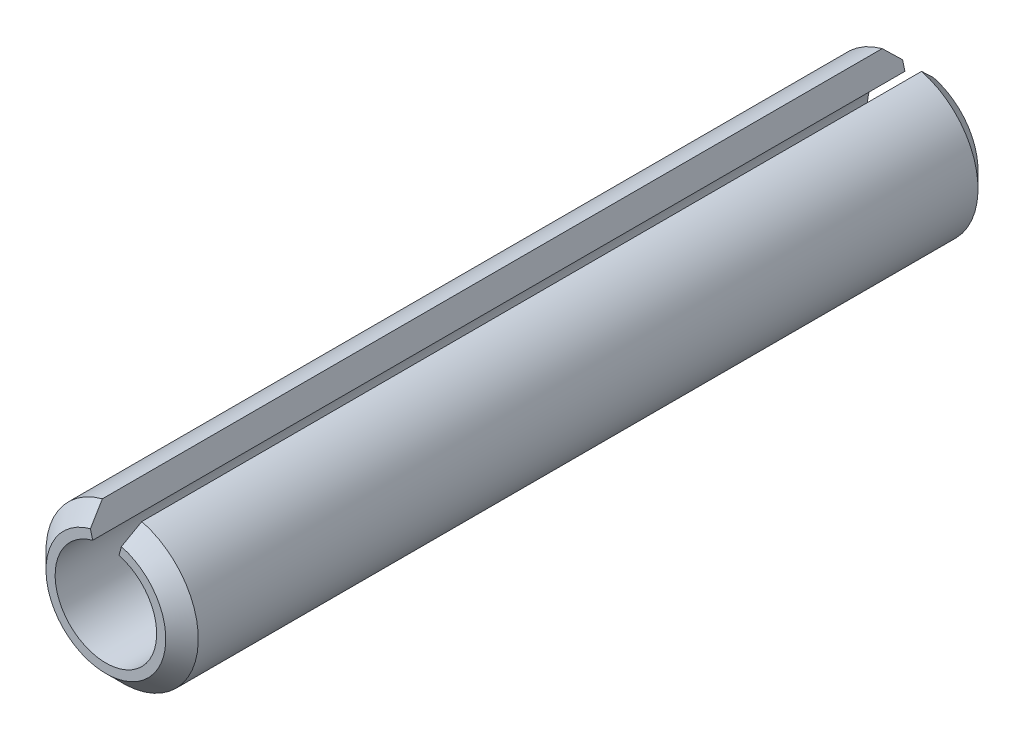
ISO-10303-21;
HEADER;
FILE_DESCRIPTION(('STEP AP214'),'2;1');
FILE_NAME('part.step','',(''),(''),'','','');
FILE_SCHEMA(('AUTOMOTIVE_DESIGN { 1 0 10303 214 1 1 1 1 }'));
ENDSEC;
DATA;
#1=APPLICATION_CONTEXT('core data for automotive mechanical design processes');
#2=APPLICATION_PROTOCOL_DEFINITION('international standard','automotive_design',2000,#1);
#3=PRODUCT_CONTEXT('',#1,'mechanical');
#4=PRODUCT('Part','Part','',(#3));
#5=PRODUCT_RELATED_PRODUCT_CATEGORY('part','',(#4));
#6=PRODUCT_DEFINITION_FORMATION('','',#4);
#7=PRODUCT_DEFINITION_CONTEXT('part definition',#1,'design');
#8=PRODUCT_DEFINITION('design','',#6,#7);
#9=PRODUCT_DEFINITION_SHAPE('','',#8);
#10=(LENGTH_UNIT() NAMED_UNIT(*) SI_UNIT(.MILLI.,.METRE.));
#11=(NAMED_UNIT(*) PLANE_ANGLE_UNIT() SI_UNIT($,.RADIAN.));
#12=(NAMED_UNIT(*) SI_UNIT($,.STERADIAN.) SOLID_ANGLE_UNIT());
#13=UNCERTAINTY_MEASURE_WITH_UNIT(LENGTH_MEASURE(1.E-05),#10,'distance_accuracy_value','');
#14=(GEOMETRIC_REPRESENTATION_CONTEXT(3) GLOBAL_UNCERTAINTY_ASSIGNED_CONTEXT((#13)) GLOBAL_UNIT_ASSIGNED_CONTEXT((#10,
#11,#12)) REPRESENTATION_CONTEXT('',''));
#15=CARTESIAN_POINT('',(0.,0.,0.));
#16=DIRECTION('',(0.,0.,1.));
#17=DIRECTION('',(1.,0.,0.));
#18=AXIS2_PLACEMENT_3D('',#15,#16,#17);
#19=CARTESIAN_POINT('',(0.,0.,6.35));
#20=DIRECTION('',(0.,0.,-1.));
#21=DIRECTION('',(-1.,0.,0.));
#22=AXIS2_PLACEMENT_3D('',#19,#20,#21);
#23=CYLINDRICAL_SURFACE('',#22,0.79375);
#24=CARTESIAN_POINT('',(0.,0.,-6.35));
#25=DIRECTION('',(0.,0.,-1.));
#26=DIRECTION('',(1.,0.,0.));
#27=AXIS2_PLACEMENT_3D('',#24,#25,#26);
#28=CIRCLE('',#27,0.79375);
#29=CARTESIAN_POINT('',(0.205437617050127,0.766703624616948,-6.35));
#30=VERTEX_POINT('',#29);
#31=CARTESIAN_POINT('',(-0.205437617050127,0.766703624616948,-6.35));
#32=VERTEX_POINT('',#31);
#33=EDGE_CURVE('E91',#30,#32,#28,.T.);
#34=ORIENTED_EDGE('',*,*,#33,.T.);
#35=DIRECTION('',(0.,0.,-1.));
#36=VECTOR('',#35,1.);
#37=CARTESIAN_POINT('',(-0.205437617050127,0.766703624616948,6.35));
#38=LINE('',#37,#36);
#39=CARTESIAN_POINT('',(-0.205437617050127,0.766703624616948,6.35));
#40=VERTEX_POINT('',#39);
#41=EDGE_CURVE('E96',#40,#32,#38,.T.);
#42=ORIENTED_EDGE('',*,*,#41,.F.);
#43=CARTESIAN_POINT('',(0.,0.,6.35));
#44=DIRECTION('',(0.,0.,-1.));
#45=DIRECTION('',(1.,0.,0.));
#46=AXIS2_PLACEMENT_3D('',#43,#44,#45);
#47=CIRCLE('',#46,0.79375);
#48=CARTESIAN_POINT('',(0.205437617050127,0.766703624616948,6.35));
#49=VERTEX_POINT('',#48);
#50=EDGE_CURVE('E111',#49,#40,#47,.T.);
#51=ORIENTED_EDGE('',*,*,#50,.F.);
#52=DIRECTION('',(0.,0.,-1.));
#53=VECTOR('',#52,1.);
#54=CARTESIAN_POINT('',(0.205437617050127,0.766703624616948,6.35));
#55=LINE('',#54,#53);
#56=EDGE_CURVE('E107',#49,#30,#55,.T.);
#57=ORIENTED_EDGE('',*,*,#56,.T.);
#58=EDGE_LOOP('',(#34,#42,#51,#57));
#59=FACE_BOUND('',#58,.T.);
#60=ADVANCED_FACE('F35',(#59),#23,.F.);
#61=CARTESIAN_POINT('',(-0.205437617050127,0.766703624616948,6.35));
#62=DIRECTION('',(-0.965925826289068,-0.258819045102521,0.));
#63=DIRECTION('',(0.258819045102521,-0.965925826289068,0.));
#64=AXIS2_PLACEMENT_3D('',#61,#62,#63);
#65=PLANE('',#64);
#66=DIRECTION('',(-0.258819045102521,0.965925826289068,0.));
#67=VECTOR('',#66,1.);
#68=CARTESIAN_POINT('',(-0.205437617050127,0.766703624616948,-6.35));
#69=LINE('',#68,#67);
#70=CARTESIAN_POINT('',(-0.24241638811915,0.904710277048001,-6.35));
#71=VERTEX_POINT('',#70);
#72=EDGE_CURVE('E87',#32,#71,#69,.T.);
#73=ORIENTED_EDGE('',*,*,#72,.T.);
#74=DIRECTION('',(0.183012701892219,-0.68301270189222,-0.707106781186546));
#75=VECTOR('',#74,1.);
#76=CARTESIAN_POINT('',(0.,0.,-7.286625));
#77=LINE('',#76,#75);
#78=CARTESIAN_POINT('',(-0.308156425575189,1.15005543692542,-6.096));
#79=VERTEX_POINT('',#78);
#80=EDGE_CURVE('E42',#71,#79,#77,.F.);
#81=ORIENTED_EDGE('',*,*,#80,.T.);
#82=DIRECTION('',(0.,0.,-1.));
#83=VECTOR('',#82,1.);
#84=CARTESIAN_POINT('',(-0.308156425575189,1.15005543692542,6.35));
#85=LINE('',#84,#83);
#86=CARTESIAN_POINT('',(-0.308156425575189,1.15005543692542,6.096));
#87=VERTEX_POINT('',#86);
#88=EDGE_CURVE('E103',#87,#79,#85,.T.);
#89=ORIENTED_EDGE('',*,*,#88,.F.);
#90=DIRECTION('',(-0.183012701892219,0.683012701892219,-0.707106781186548));
#91=VECTOR('',#90,1.);
#92=CARTESIAN_POINT('',(0.,0.,7.286625));
#93=LINE('',#92,#91);
#94=CARTESIAN_POINT('',(-0.242416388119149,0.904710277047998,6.35));
#95=VERTEX_POINT('',#94);
#96=EDGE_CURVE('E49',#87,#95,#93,.F.);
#97=ORIENTED_EDGE('',*,*,#96,.T.);
#98=DIRECTION('',(-0.258819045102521,0.965925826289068,0.));
#99=VECTOR('',#98,1.);
#100=CARTESIAN_POINT('',(-0.205437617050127,0.766703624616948,6.35));
#101=LINE('',#100,#99);
#102=EDGE_CURVE('E98',#40,#95,#101,.T.);
#103=ORIENTED_EDGE('',*,*,#102,.F.);
#104=ORIENTED_EDGE('',*,*,#41,.T.);
#105=EDGE_LOOP('',(#73,#81,#89,#97,#103,#104));
#106=FACE_BOUND('',#105,.T.);
#107=ADVANCED_FACE('F97',(#106),#65,.F.);
#108=CARTESIAN_POINT('',(0.,0.,6.35));
#109=DIRECTION('',(0.,0.,-1.));
#110=DIRECTION('',(-1.,0.,0.));
#111=AXIS2_PLACEMENT_3D('',#108,#109,#110);
#112=CYLINDRICAL_SURFACE('',#111,1.190625);
#113=ORIENTED_EDGE('',*,*,#88,.T.);
#114=CARTESIAN_POINT('',(0.,0.,-6.096));
#115=DIRECTION('',(0.,0.,1.));
#116=DIRECTION('',(1.,0.,0.));
#117=AXIS2_PLACEMENT_3D('',#114,#115,#116);
#118=CIRCLE('',#117,1.190625);
#119=CARTESIAN_POINT('',(0.308156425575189,1.15005543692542,-6.096));
#120=VERTEX_POINT('',#119);
#121=EDGE_CURVE('E123',#79,#120,#118,.T.);
#122=ORIENTED_EDGE('',*,*,#121,.T.);
#123=DIRECTION('',(0.,0.,-1.));
#124=VECTOR('',#123,1.);
#125=CARTESIAN_POINT('',(0.308156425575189,1.15005543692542,6.35));
#126=LINE('',#125,#124);
#127=CARTESIAN_POINT('',(0.308156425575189,1.15005543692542,6.096));
#128=VERTEX_POINT('',#127);
#129=EDGE_CURVE('E117',#128,#120,#126,.T.);
#130=ORIENTED_EDGE('',*,*,#129,.F.);
#131=CARTESIAN_POINT('',(0.,0.,6.096));
#132=DIRECTION('',(0.,0.,1.));
#133=DIRECTION('',(1.,0.,0.));
#134=AXIS2_PLACEMENT_3D('',#131,#132,#133);
#135=CIRCLE('',#134,1.190625);
#136=EDGE_CURVE('E102',#128,#87,#135,.F.);
#137=ORIENTED_EDGE('',*,*,#136,.T.);
#138=EDGE_LOOP('',(#113,#122,#130,#137));
#139=FACE_BOUND('',#138,.T.);
#140=ADVANCED_FACE('F134',(#139),#112,.T.);
#141=CARTESIAN_POINT('',(0.205437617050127,0.766703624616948,6.35));
#142=DIRECTION('',(0.965925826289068,-0.258819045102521,0.));
#143=DIRECTION('',(0.258819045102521,0.965925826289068,0.));
#144=AXIS2_PLACEMENT_3D('',#141,#142,#143);
#145=PLANE('',#144);
#146=ORIENTED_EDGE('',*,*,#129,.T.);
#147=DIRECTION('',(0.183012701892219,0.68301270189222,0.707106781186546));
#148=VECTOR('',#147,1.);
#149=CARTESIAN_POINT('',(0.,0.,-7.286625));
#150=LINE('',#149,#148);
#151=CARTESIAN_POINT('',(0.24241638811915,0.904710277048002,-6.35));
#152=VERTEX_POINT('',#151);
#153=EDGE_CURVE('E128',#120,#152,#150,.F.);
#154=ORIENTED_EDGE('',*,*,#153,.T.);
#155=DIRECTION('',(-0.258819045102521,-0.965925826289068,0.));
#156=VECTOR('',#155,1.);
#157=CARTESIAN_POINT('',(0.205437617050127,0.766703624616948,-6.35));
#158=LINE('',#157,#156);
#159=EDGE_CURVE('E93',#152,#30,#158,.T.);
#160=ORIENTED_EDGE('',*,*,#159,.T.);
#161=ORIENTED_EDGE('',*,*,#56,.F.);
#162=DIRECTION('',(-0.258819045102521,-0.965925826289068,0.));
#163=VECTOR('',#162,1.);
#164=CARTESIAN_POINT('',(0.205437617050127,0.766703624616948,6.35));
#165=LINE('',#164,#163);
#166=CARTESIAN_POINT('',(0.242416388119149,0.904710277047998,6.35));
#167=VERTEX_POINT('',#166);
#168=EDGE_CURVE('E114',#167,#49,#165,.T.);
#169=ORIENTED_EDGE('',*,*,#168,.F.);
#170=DIRECTION('',(-0.183012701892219,-0.683012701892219,0.707106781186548));
#171=VECTOR('',#170,1.);
#172=CARTESIAN_POINT('',(0.,0.,7.286625));
#173=LINE('',#172,#171);
#174=EDGE_CURVE('E126',#167,#128,#173,.F.);
#175=ORIENTED_EDGE('',*,*,#174,.T.);
#176=EDGE_LOOP('',(#146,#154,#160,#161,#169,#175));
#177=FACE_BOUND('',#176,.T.);
#178=ADVANCED_FACE('F139',(#177),#145,.F.);
#179=CARTESIAN_POINT('',(0.,0.,6.35));
#180=DIRECTION('',(0.,0.,1.));
#181=DIRECTION('',(1.,0.,0.));
#182=AXIS2_PLACEMENT_3D('',#179,#180,#181);
#183=PLANE('',#182);
#184=ORIENTED_EDGE('',*,*,#102,.T.);
#185=CARTESIAN_POINT('',(0.,0.,6.35));
#186=DIRECTION('',(0.,0.,1.));
#187=DIRECTION('',(1.,0.,0.));
#188=AXIS2_PLACEMENT_3D('',#185,#186,#187);
#189=CIRCLE('',#188,0.936625);
#190=EDGE_CURVE('E11',#95,#167,#189,.T.);
#191=ORIENTED_EDGE('',*,*,#190,.T.);
#192=ORIENTED_EDGE('',*,*,#168,.T.);
#193=ORIENTED_EDGE('',*,*,#50,.T.);
#194=EDGE_LOOP('',(#184,#191,#192,#193));
#195=FACE_BOUND('',#194,.T.);
#196=ADVANCED_FACE('F145',(#195),#183,.T.);
#197=CARTESIAN_POINT('',(0.,0.,-6.35));
#198=DIRECTION('',(0.,0.,1.));
#199=DIRECTION('',(1.,0.,0.));
#200=AXIS2_PLACEMENT_3D('',#197,#198,#199);
#201=PLANE('',#200);
#202=ORIENTED_EDGE('',*,*,#159,.F.);
#203=CARTESIAN_POINT('',(0.,0.,-6.35));
#204=DIRECTION('',(0.,0.,1.));
#205=DIRECTION('',(1.,0.,0.));
#206=AXIS2_PLACEMENT_3D('',#203,#204,#205);
#207=CIRCLE('',#206,0.936625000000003);
#208=EDGE_CURVE('E57',#152,#71,#207,.F.);
#209=ORIENTED_EDGE('',*,*,#208,.T.);
#210=ORIENTED_EDGE('',*,*,#72,.F.);
#211=ORIENTED_EDGE('',*,*,#33,.F.);
#212=EDGE_LOOP('',(#202,#209,#210,#211));
#213=FACE_BOUND('',#212,.T.);
#214=ADVANCED_FACE('F89',(#213),#201,.F.);
#215=CARTESIAN_POINT('',(0.,0.,-6.096));
#216=DIRECTION('',(0.,0.,1.));
#217=DIRECTION('',(1.,0.,0.));
#218=AXIS2_PLACEMENT_3D('',#215,#216,#217);
#219=CONICAL_SURFACE('',#218,1.190625,0.78539816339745);
#220=ORIENTED_EDGE('',*,*,#80,.F.);
#221=ORIENTED_EDGE('',*,*,#208,.F.);
#222=ORIENTED_EDGE('',*,*,#153,.F.);
#223=ORIENTED_EDGE('',*,*,#121,.F.);
#224=EDGE_LOOP('',(#220,#221,#222,#223));
#225=FACE_BOUND('',#224,.T.);
#226=ADVANCED_FACE('F137',(#225),#219,.T.);
#227=CARTESIAN_POINT('',(0.,0.,6.35));
#228=DIRECTION('',(0.,0.,-1.));
#229=DIRECTION('',(-1.,0.,0.));
#230=AXIS2_PLACEMENT_3D('',#227,#228,#229);
#231=CONICAL_SURFACE('',#230,0.936625,0.785398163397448);
#232=ORIENTED_EDGE('',*,*,#96,.F.);
#233=ORIENTED_EDGE('',*,*,#136,.F.);
#234=ORIENTED_EDGE('',*,*,#174,.F.);
#235=ORIENTED_EDGE('',*,*,#190,.F.);
#236=EDGE_LOOP('',(#232,#233,#234,#235));
#237=FACE_BOUND('',#236,.T.);
#238=ADVANCED_FACE('F142',(#237),#231,.T.);
#239=CLOSED_SHELL('',(#60,#107,#140,#178,#196,#214,#226,#238));
#240=MANIFOLD_SOLID_BREP('B2',#239);
#241=ADVANCED_BREP_SHAPE_REPRESENTATION('',(#18,#240),#14);
#242=SHAPE_DEFINITION_REPRESENTATION(#9,#241);
ENDSEC;
END-ISO-10303-21;
